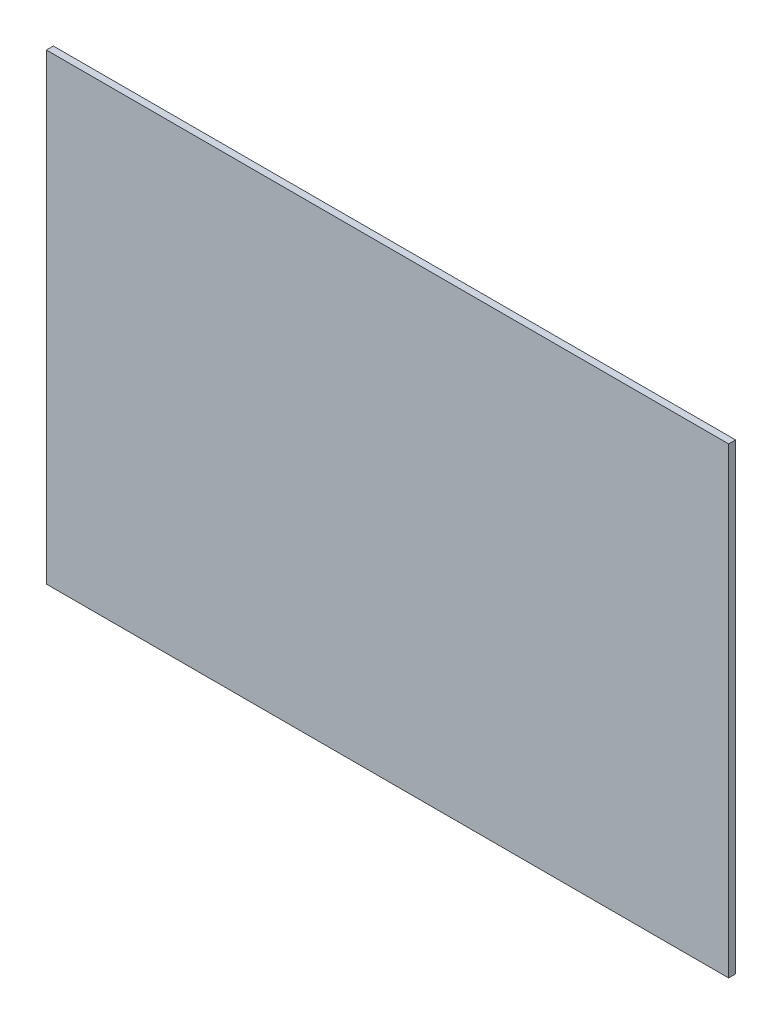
ISO-10303-21;
HEADER;
FILE_DESCRIPTION(('STEP AP214'),'2;1');
FILE_NAME('part.step','',(''),(''),'','','');
FILE_SCHEMA(('AUTOMOTIVE_DESIGN { 1 0 10303 214 1 1 1 1 }'));
ENDSEC;
DATA;
#1=APPLICATION_CONTEXT('core data for automotive mechanical design processes');
#2=APPLICATION_PROTOCOL_DEFINITION('international standard','automotive_design',2000,#1);
#3=PRODUCT_CONTEXT('',#1,'mechanical');
#4=PRODUCT('Part','Part','',(#3));
#5=PRODUCT_RELATED_PRODUCT_CATEGORY('part','',(#4));
#6=PRODUCT_DEFINITION_FORMATION('','',#4);
#7=PRODUCT_DEFINITION_CONTEXT('part definition',#1,'design');
#8=PRODUCT_DEFINITION('design','',#6,#7);
#9=PRODUCT_DEFINITION_SHAPE('','',#8);
#10=(LENGTH_UNIT() NAMED_UNIT(*) SI_UNIT(.MILLI.,.METRE.));
#11=(NAMED_UNIT(*) PLANE_ANGLE_UNIT() SI_UNIT($,.RADIAN.));
#12=(NAMED_UNIT(*) SI_UNIT($,.STERADIAN.) SOLID_ANGLE_UNIT());
#13=UNCERTAINTY_MEASURE_WITH_UNIT(LENGTH_MEASURE(1.E-05),#10,'distance_accuracy_value','');
#14=(GEOMETRIC_REPRESENTATION_CONTEXT(3) GLOBAL_UNCERTAINTY_ASSIGNED_CONTEXT((#13)) GLOBAL_UNIT_ASSIGNED_CONTEXT((#10,
#11,#12)) REPRESENTATION_CONTEXT('',''));
#15=CARTESIAN_POINT('',(0.,0.,0.));
#16=DIRECTION('',(0.,0.,1.));
#17=DIRECTION('',(1.,0.,0.));
#18=AXIS2_PLACEMENT_3D('',#15,#16,#17);
#19=CARTESIAN_POINT('',(147.5,100.,3.));
#20=DIRECTION('',(-1.,0.,0.));
#21=DIRECTION('',(0.,0.,1.));
#22=AXIS2_PLACEMENT_3D('',#19,#20,#21);
#23=PLANE('',#22);
#24=DIRECTION('',(0.,1.,0.));
#25=VECTOR('',#24,1.);
#26=CARTESIAN_POINT('',(147.5,100.,0.));
#27=LINE('',#26,#25);
#28=CARTESIAN_POINT('',(147.5,-100.,0.));
#29=VERTEX_POINT('',#28);
#30=CARTESIAN_POINT('',(147.5,100.,0.));
#31=VERTEX_POINT('',#30);
#32=EDGE_CURVE('E107',#29,#31,#27,.T.);
#33=ORIENTED_EDGE('',*,*,#32,.T.);
#34=DIRECTION('',(0.,0.,-1.));
#35=VECTOR('',#34,1.);
#36=CARTESIAN_POINT('',(147.5,100.,3.));
#37=LINE('',#36,#35);
#38=CARTESIAN_POINT('',(147.5,100.,3.));
#39=VERTEX_POINT('',#38);
#40=EDGE_CURVE('E11',#39,#31,#37,.T.);
#41=ORIENTED_EDGE('',*,*,#40,.F.);
#42=DIRECTION('',(0.,1.,0.));
#43=VECTOR('',#42,1.);
#44=CARTESIAN_POINT('',(147.5,100.,3.));
#45=LINE('',#44,#43);
#46=CARTESIAN_POINT('',(147.5,-100.,3.));
#47=VERTEX_POINT('',#46);
#48=EDGE_CURVE('E91',#47,#39,#45,.T.);
#49=ORIENTED_EDGE('',*,*,#48,.F.);
#50=DIRECTION('',(0.,0.,-1.));
#51=VECTOR('',#50,1.);
#52=CARTESIAN_POINT('',(147.5,-100.,3.));
#53=LINE('',#52,#51);
#54=EDGE_CURVE('E103',#47,#29,#53,.T.);
#55=ORIENTED_EDGE('',*,*,#54,.T.);
#56=EDGE_LOOP('',(#33,#41,#49,#55));
#57=FACE_BOUND('',#56,.T.);
#58=ADVANCED_FACE('F39',(#57),#23,.F.);
#59=CARTESIAN_POINT('',(-147.5,100.,3.));
#60=DIRECTION('',(0.,-1.,0.));
#61=DIRECTION('',(0.,0.,-1.));
#62=AXIS2_PLACEMENT_3D('',#59,#60,#61);
#63=PLANE('',#62);
#64=DIRECTION('',(-1.,0.,0.));
#65=VECTOR('',#64,1.);
#66=CARTESIAN_POINT('',(-147.5,100.,0.));
#67=LINE('',#66,#65);
#68=CARTESIAN_POINT('',(-147.5,100.,0.));
#69=VERTEX_POINT('',#68);
#70=EDGE_CURVE('E96',#31,#69,#67,.T.);
#71=ORIENTED_EDGE('',*,*,#70,.T.);
#72=DIRECTION('',(0.,0.,-1.));
#73=VECTOR('',#72,1.);
#74=CARTESIAN_POINT('',(-147.5,100.,3.));
#75=LINE('',#74,#73);
#76=CARTESIAN_POINT('',(-147.5,100.,3.));
#77=VERTEX_POINT('',#76);
#78=EDGE_CURVE('E48',#77,#69,#75,.T.);
#79=ORIENTED_EDGE('',*,*,#78,.F.);
#80=DIRECTION('',(-1.,0.,0.));
#81=VECTOR('',#80,1.);
#82=CARTESIAN_POINT('',(-147.5,100.,3.));
#83=LINE('',#82,#81);
#84=EDGE_CURVE('E86',#39,#77,#83,.T.);
#85=ORIENTED_EDGE('',*,*,#84,.F.);
#86=ORIENTED_EDGE('',*,*,#40,.T.);
#87=EDGE_LOOP('',(#71,#79,#85,#86));
#88=FACE_BOUND('',#87,.T.);
#89=ADVANCED_FACE('F95',(#88),#63,.F.);
#90=CARTESIAN_POINT('',(-147.5,100.,3.));
#91=DIRECTION('',(1.,0.,0.));
#92=DIRECTION('',(0.,0.,-1.));
#93=AXIS2_PLACEMENT_3D('',#90,#91,#92);
#94=PLANE('',#93);
#95=DIRECTION('',(0.,-1.,0.));
#96=VECTOR('',#95,1.);
#97=CARTESIAN_POINT('',(-147.5,100.,0.));
#98=LINE('',#97,#96);
#99=CARTESIAN_POINT('',(-147.5,-100.,0.));
#100=VERTEX_POINT('',#99);
#101=EDGE_CURVE('E73',#69,#100,#98,.T.);
#102=ORIENTED_EDGE('',*,*,#101,.T.);
#103=DIRECTION('',(0.,0.,-1.));
#104=VECTOR('',#103,1.);
#105=CARTESIAN_POINT('',(-147.5,-100.,3.));
#106=LINE('',#105,#104);
#107=CARTESIAN_POINT('',(-147.5,-100.,3.));
#108=VERTEX_POINT('',#107);
#109=EDGE_CURVE('E98',#108,#100,#106,.T.);
#110=ORIENTED_EDGE('',*,*,#109,.F.);
#111=DIRECTION('',(0.,-1.,0.));
#112=VECTOR('',#111,1.);
#113=CARTESIAN_POINT('',(-147.5,100.,3.));
#114=LINE('',#113,#112);
#115=EDGE_CURVE('E89',#77,#108,#114,.T.);
#116=ORIENTED_EDGE('',*,*,#115,.F.);
#117=ORIENTED_EDGE('',*,*,#78,.T.);
#118=EDGE_LOOP('',(#102,#110,#116,#117));
#119=FACE_BOUND('',#118,.T.);
#120=ADVANCED_FACE('F99',(#119),#94,.F.);
#121=CARTESIAN_POINT('',(-147.5,-100.,3.));
#122=DIRECTION('',(0.,1.,0.));
#123=DIRECTION('',(0.,0.,1.));
#124=AXIS2_PLACEMENT_3D('',#121,#122,#123);
#125=PLANE('',#124);
#126=DIRECTION('',(1.,0.,0.));
#127=VECTOR('',#126,1.);
#128=CARTESIAN_POINT('',(-147.5,-100.,0.));
#129=LINE('',#128,#127);
#130=EDGE_CURVE('E79',#100,#29,#129,.T.);
#131=ORIENTED_EDGE('',*,*,#130,.T.);
#132=ORIENTED_EDGE('',*,*,#54,.F.);
#133=DIRECTION('',(1.,0.,0.));
#134=VECTOR('',#133,1.);
#135=CARTESIAN_POINT('',(-147.5,-100.,3.));
#136=LINE('',#135,#134);
#137=EDGE_CURVE('E56',#108,#47,#136,.T.);
#138=ORIENTED_EDGE('',*,*,#137,.F.);
#139=ORIENTED_EDGE('',*,*,#109,.T.);
#140=EDGE_LOOP('',(#131,#132,#138,#139));
#141=FACE_BOUND('',#140,.T.);
#142=ADVANCED_FACE('F120',(#141),#125,.F.);
#143=CARTESIAN_POINT('',(0.,0.,3.));
#144=DIRECTION('',(0.,0.,1.));
#145=DIRECTION('',(1.,0.,0.));
#146=AXIS2_PLACEMENT_3D('',#143,#144,#145);
#147=PLANE('',#146);
#148=ORIENTED_EDGE('',*,*,#48,.T.);
#149=ORIENTED_EDGE('',*,*,#84,.T.);
#150=ORIENTED_EDGE('',*,*,#115,.T.);
#151=ORIENTED_EDGE('',*,*,#137,.T.);
#152=EDGE_LOOP('',(#148,#149,#150,#151));
#153=FACE_BOUND('',#152,.T.);
#154=ADVANCED_FACE('F87',(#153),#147,.T.);
#155=CARTESIAN_POINT('',(0.,0.,0.));
#156=DIRECTION('',(0.,0.,1.));
#157=DIRECTION('',(1.,0.,0.));
#158=AXIS2_PLACEMENT_3D('',#155,#156,#157);
#159=PLANE('',#158);
#160=ORIENTED_EDGE('',*,*,#32,.F.);
#161=ORIENTED_EDGE('',*,*,#130,.F.);
#162=ORIENTED_EDGE('',*,*,#101,.F.);
#163=ORIENTED_EDGE('',*,*,#70,.F.);
#164=EDGE_LOOP('',(#160,#161,#162,#163));
#165=FACE_BOUND('',#164,.T.);
#166=ADVANCED_FACE('F123',(#165),#159,.F.);
#167=CLOSED_SHELL('',(#58,#89,#120,#142,#154,#166));
#168=MANIFOLD_SOLID_BREP('B2',#167);
#169=ADVANCED_BREP_SHAPE_REPRESENTATION('',(#18,#168),#14);
#170=SHAPE_DEFINITION_REPRESENTATION(#9,#169);
ENDSEC;
END-ISO-10303-21;
